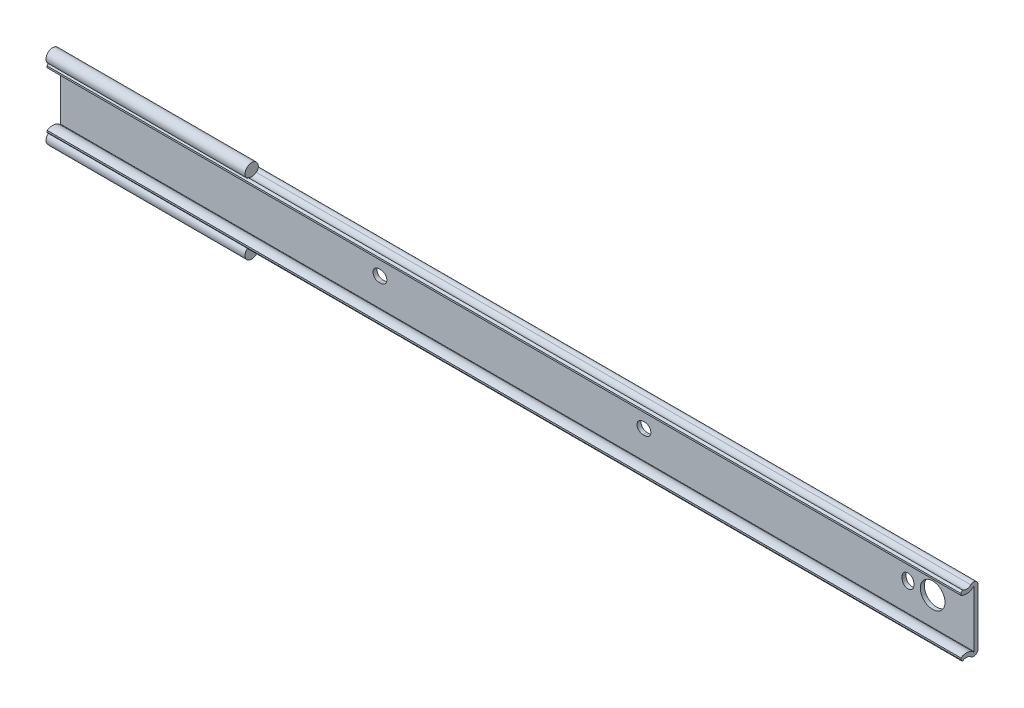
ISO-10303-21;
HEADER;
FILE_DESCRIPTION(('STEP AP214'),'2;1');
FILE_NAME('part.step','',(''),(''),'','','');
FILE_SCHEMA(('AUTOMOTIVE_DESIGN { 1 0 10303 214 1 1 1 1 }'));
ENDSEC;
DATA;
#1=APPLICATION_CONTEXT('core data for automotive mechanical design processes');
#2=APPLICATION_PROTOCOL_DEFINITION('international standard','automotive_design',2000,#1);
#3=PRODUCT_CONTEXT('',#1,'mechanical');
#4=PRODUCT('Part','Part','',(#3));
#5=PRODUCT_RELATED_PRODUCT_CATEGORY('part','',(#4));
#6=PRODUCT_DEFINITION_FORMATION('','',#4);
#7=PRODUCT_DEFINITION_CONTEXT('part definition',#1,'design');
#8=PRODUCT_DEFINITION('design','',#6,#7);
#9=PRODUCT_DEFINITION_SHAPE('','',#8);
#10=(LENGTH_UNIT() NAMED_UNIT(*) SI_UNIT(.MILLI.,.METRE.));
#11=(NAMED_UNIT(*) PLANE_ANGLE_UNIT() SI_UNIT($,.RADIAN.));
#12=(NAMED_UNIT(*) SI_UNIT($,.STERADIAN.) SOLID_ANGLE_UNIT());
#13=UNCERTAINTY_MEASURE_WITH_UNIT(LENGTH_MEASURE(1.E-05),#10,'distance_accuracy_value','');
#14=(GEOMETRIC_REPRESENTATION_CONTEXT(3) GLOBAL_UNCERTAINTY_ASSIGNED_CONTEXT((#13)) GLOBAL_UNIT_ASSIGNED_CONTEXT((#10,
#11,#12)) REPRESENTATION_CONTEXT('',''));
#15=CARTESIAN_POINT('',(0.,0.,0.));
#16=DIRECTION('',(0.,0.,1.));
#17=DIRECTION('',(1.,0.,0.));
#18=AXIS2_PLACEMENT_3D('',#15,#16,#17);
#19=CARTESIAN_POINT('',(-123.,13.9172237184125,4.44999970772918));
#20=DIRECTION('',(1.,0.,0.));
#21=DIRECTION('',(0.,0.,-1.));
#22=AXIS2_PLACEMENT_3D('',#19,#20,#21);
#23=CYLINDRICAL_SURFACE('',#22,2.55000008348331);
#24=DIRECTION('',(1.,0.,0.));
#25=VECTOR('',#24,1.);
#26=CARTESIAN_POINT('',(-123.,12.0075849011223,2.76009438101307));
#27=LINE('',#26,#25);
#28=CARTESIAN_POINT('',(-46.4,12.0075849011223,2.76009438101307));
#29=VERTEX_POINT('',#28);
#30=CARTESIAN_POINT('',(228.6,12.0075849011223,2.76009438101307));
#31=VERTEX_POINT('',#30);
#32=EDGE_CURVE('E356',#29,#31,#27,.T.);
#33=ORIENTED_EDGE('',*,*,#32,.F.);
#34=CARTESIAN_POINT('',(-46.4,13.9172237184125,4.44999970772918));
#35=DIRECTION('',(-1.,0.,0.));
#36=DIRECTION('',(0.,0.,1.));
#37=AXIS2_PLACEMENT_3D('',#34,#35,#36);
#38=CIRCLE('',#37,2.55000008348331);
#39=CARTESIAN_POINT('',(-46.4,11.8807031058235,5.98462807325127));
#40=VERTEX_POINT('',#39);
#41=EDGE_CURVE('E410',#29,#40,#38,.T.);
#42=ORIENTED_EDGE('',*,*,#41,.T.);
#43=DIRECTION('',(1.,0.,0.));
#44=VECTOR('',#43,1.);
#45=CARTESIAN_POINT('',(-123.,11.8807031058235,5.98462807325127));
#46=LINE('',#45,#44);
#47=CARTESIAN_POINT('',(228.6,11.8807031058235,5.98462807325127));
#48=VERTEX_POINT('',#47);
#49=EDGE_CURVE('E383',#40,#48,#46,.T.);
#50=ORIENTED_EDGE('',*,*,#49,.T.);
#51=CARTESIAN_POINT('',(228.6,13.9172237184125,4.44999970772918));
#52=DIRECTION('',(-1.,0.,0.));
#53=DIRECTION('',(0.,0.,-1.));
#54=AXIS2_PLACEMENT_3D('',#51,#52,#53);
#55=CIRCLE('',#54,2.55000008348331);
#56=EDGE_CURVE('E288',#31,#48,#55,.T.);
#57=ORIENTED_EDGE('',*,*,#56,.F.);
#58=EDGE_LOOP('',(#33,#42,#50,#57));
#59=FACE_BOUND('',#58,.T.);
#60=ADVANCED_FACE('F14',(#59),#23,.F.);
#61=CARTESIAN_POINT('',(-123.,-10.760000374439,0.));
#62=DIRECTION('',(0.,0.,-1.));
#63=DIRECTION('',(-1.,0.,0.));
#64=AXIS2_PLACEMENT_3D('',#61,#62,#63);
#65=PLANE('',#64);
#66=DIRECTION('',(0.,1.,0.));
#67=VECTOR('',#66,1.);
#68=CARTESIAN_POINT('',(-123.,-10.760000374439,0.));
#69=LINE('',#68,#67);
#70=CARTESIAN_POINT('',(-123.,-10.760000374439,0.));
#71=VERTEX_POINT('',#70);
#72=CARTESIAN_POINT('',(-123.,10.7644476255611,0.));
#73=VERTEX_POINT('',#72);
#74=EDGE_CURVE('E354',#71,#73,#69,.T.);
#75=ORIENTED_EDGE('',*,*,#74,.T.);
#76=DIRECTION('',(1.,0.,0.));
#77=VECTOR('',#76,1.);
#78=CARTESIAN_POINT('',(-123.,10.7644476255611,0.));
#79=LINE('',#78,#77);
#80=CARTESIAN_POINT('',(228.6,10.7644476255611,0.));
#81=VERTEX_POINT('',#80);
#82=EDGE_CURVE('E357',#73,#81,#79,.T.);
#83=ORIENTED_EDGE('',*,*,#82,.T.);
#84=DIRECTION('',(0.,1.,0.));
#85=VECTOR('',#84,1.);
#86=CARTESIAN_POINT('',(228.6,-10.760000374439,0.));
#87=LINE('',#86,#85);
#88=CARTESIAN_POINT('',(228.6,-10.760000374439,0.));
#89=VERTEX_POINT('',#88);
#90=EDGE_CURVE('E323',#89,#81,#87,.T.);
#91=ORIENTED_EDGE('',*,*,#90,.F.);
#92=DIRECTION('',(1.,0.,0.));
#93=VECTOR('',#92,1.);
#94=CARTESIAN_POINT('',(-123.,-10.760000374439,0.));
#95=LINE('',#94,#93);
#96=EDGE_CURVE('E360',#71,#89,#95,.T.);
#97=ORIENTED_EDGE('',*,*,#96,.F.);
#98=EDGE_LOOP('',(#75,#83,#91,#97));
#99=FACE_BOUND('',#98,.T.);
#100=CARTESIAN_POINT('',(212.7,0.00222299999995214,0.));
#101=DIRECTION('',(0.,0.,-1.));
#102=DIRECTION('',(-1.,0.,0.));
#103=AXIS2_PLACEMENT_3D('',#100,#101,#102);
#104=CIRCLE('',#103,4.75);
#105=CARTESIAN_POINT('',(207.95,0.00222299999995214,0.));
#106=VERTEX_POINT('',#105);
#107=EDGE_CURVE('E449',#106,#106,#104,.T.);
#108=ORIENTED_EDGE('',*,*,#107,.F.);
#109=EDGE_LOOP('',(#108));
#110=FACE_BOUND('',#109,.T.);
#111=CARTESIAN_POINT('',(102.,0.00222299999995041,0.));
#112=DIRECTION('',(0.,0.,-1.));
#113=DIRECTION('',(-1.,0.,0.));
#114=AXIS2_PLACEMENT_3D('',#111,#112,#113);
#115=CIRCLE('',#114,2.24999999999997);
#116=CARTESIAN_POINT('',(102.,2.25222299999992,0.));
#117=VERTEX_POINT('',#116);
#118=CARTESIAN_POINT('',(102.,-2.24777700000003,0.));
#119=VERTEX_POINT('',#118);
#120=EDGE_CURVE('E231',#117,#119,#115,.T.);
#121=ORIENTED_EDGE('',*,*,#120,.F.);
#122=DIRECTION('',(1.,0.,0.));
#123=VECTOR('',#122,1.);
#124=CARTESIAN_POINT('',(102.,2.25222299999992,0.));
#125=LINE('',#124,#123);
#126=CARTESIAN_POINT('',(101.2,2.25222299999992,0.));
#127=VERTEX_POINT('',#126);
#128=EDGE_CURVE('E236',#127,#117,#125,.T.);
#129=ORIENTED_EDGE('',*,*,#128,.F.);
#130=CARTESIAN_POINT('',(101.2,0.00222299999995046,0.));
#131=DIRECTION('',(0.,0.,-1.));
#132=DIRECTION('',(-1.,0.,0.));
#133=AXIS2_PLACEMENT_3D('',#130,#131,#132);
#134=CIRCLE('',#133,2.24999999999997);
#135=CARTESIAN_POINT('',(101.2,-2.24777700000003,0.));
#136=VERTEX_POINT('',#135);
#137=EDGE_CURVE('E215',#136,#127,#134,.T.);
#138=ORIENTED_EDGE('',*,*,#137,.F.);
#139=DIRECTION('',(-1.,0.,0.));
#140=VECTOR('',#139,1.);
#141=CARTESIAN_POINT('',(102.,-2.24777700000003,0.));
#142=LINE('',#141,#140);
#143=EDGE_CURVE('E226',#119,#136,#142,.T.);
#144=ORIENTED_EDGE('',*,*,#143,.F.);
#145=EDGE_LOOP('',(#121,#129,#138,#144));
#146=FACE_BOUND('',#145,.T.);
#147=CARTESIAN_POINT('',(203.2,-0.397777,0.));
#148=DIRECTION('',(0.,0.,-1.));
#149=DIRECTION('',(-1.,0.,0.));
#150=AXIS2_PLACEMENT_3D('',#147,#148,#149);
#151=CIRCLE('',#150,2.24999999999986);
#152=CARTESIAN_POINT('',(205.45,-0.397777,0.));
#153=VERTEX_POINT('',#152);
#154=CARTESIAN_POINT('',(200.95,-0.397777,0.));
#155=VERTEX_POINT('',#154);
#156=EDGE_CURVE('E243',#153,#155,#151,.T.);
#157=ORIENTED_EDGE('',*,*,#156,.F.);
#158=DIRECTION('',(0.,-1.,0.));
#159=VECTOR('',#158,1.);
#160=CARTESIAN_POINT('',(205.45,0.402222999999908,0.));
#161=LINE('',#160,#159);
#162=CARTESIAN_POINT('',(205.45,0.402222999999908,0.));
#163=VERTEX_POINT('',#162);
#164=EDGE_CURVE('E253',#163,#153,#161,.T.);
#165=ORIENTED_EDGE('',*,*,#164,.F.);
#166=CARTESIAN_POINT('',(203.2,0.402222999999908,0.));
#167=DIRECTION('',(0.,0.,-1.));
#168=DIRECTION('',(-1.,0.,0.));
#169=AXIS2_PLACEMENT_3D('',#166,#167,#168);
#170=CIRCLE('',#169,2.24999999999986);
#171=CARTESIAN_POINT('',(200.95,0.402222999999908,0.));
#172=VERTEX_POINT('',#171);
#173=EDGE_CURVE('E250',#172,#163,#170,.T.);
#174=ORIENTED_EDGE('',*,*,#173,.F.);
#175=DIRECTION('',(0.,1.,0.));
#176=VECTOR('',#175,1.);
#177=CARTESIAN_POINT('',(200.95,0.402222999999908,0.));
#178=LINE('',#177,#176);
#179=EDGE_CURVE('E247',#155,#172,#178,.T.);
#180=ORIENTED_EDGE('',*,*,#179,.F.);
#181=EDGE_LOOP('',(#157,#165,#174,#180));
#182=FACE_BOUND('',#181,.T.);
#183=CARTESIAN_POINT('',(-0.400000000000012,0.,0.));
#184=DIRECTION('',(0.,0.,-1.));
#185=DIRECTION('',(-1.,0.,0.));
#186=AXIS2_PLACEMENT_3D('',#183,#184,#185);
#187=CIRCLE('',#186,2.24999999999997);
#188=CARTESIAN_POINT('',(-0.400000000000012,-2.24999999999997,0.));
#189=VERTEX_POINT('',#188);
#190=CARTESIAN_POINT('',(-0.400000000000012,2.24999999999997,0.));
#191=VERTEX_POINT('',#190);
#192=EDGE_CURVE('E259',#189,#191,#187,.T.);
#193=ORIENTED_EDGE('',*,*,#192,.F.);
#194=DIRECTION('',(-1.,0.,0.));
#195=VECTOR('',#194,1.);
#196=CARTESIAN_POINT('',(0.400000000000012,-2.24999999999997,0.));
#197=LINE('',#196,#195);
#198=CARTESIAN_POINT('',(0.400000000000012,-2.24999999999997,0.));
#199=VERTEX_POINT('',#198);
#200=EDGE_CURVE('E273',#199,#189,#197,.T.);
#201=ORIENTED_EDGE('',*,*,#200,.F.);
#202=CARTESIAN_POINT('',(0.400000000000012,0.,0.));
#203=DIRECTION('',(0.,0.,-1.));
#204=DIRECTION('',(-1.,0.,0.));
#205=AXIS2_PLACEMENT_3D('',#202,#203,#204);
#206=CIRCLE('',#205,2.24999999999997);
#207=CARTESIAN_POINT('',(0.400000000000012,2.24999999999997,0.));
#208=VERTEX_POINT('',#207);
#209=EDGE_CURVE('E270',#208,#199,#206,.T.);
#210=ORIENTED_EDGE('',*,*,#209,.F.);
#211=DIRECTION('',(1.,0.,0.));
#212=VECTOR('',#211,1.);
#213=CARTESIAN_POINT('',(0.400000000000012,2.24999999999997,0.));
#214=LINE('',#213,#212);
#215=EDGE_CURVE('E267',#191,#208,#214,.T.);
#216=ORIENTED_EDGE('',*,*,#215,.F.);
#217=EDGE_LOOP('',(#193,#201,#210,#216));
#218=FACE_BOUND('',#217,.T.);
#219=ADVANCED_FACE('F233',(#99,#110,#146,#182,#218),#65,.T.);
#220=CARTESIAN_POINT('',(-123.,-10.7822812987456,1.54999983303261));
#221=DIRECTION('',(0.,0.,1.));
#222=DIRECTION('',(0.,-1.,0.));
#223=AXIS2_PLACEMENT_3D('',#220,#221,#222);
#224=PLANE('',#223);
#225=DIRECTION('',(0.,-1.,0.));
#226=VECTOR('',#225,1.);
#227=CARTESIAN_POINT('',(-123.,-10.7822812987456,1.54999983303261));
#228=LINE('',#227,#226);
#229=CARTESIAN_POINT('',(-123.,10.7867285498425,1.54999983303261));
#230=VERTEX_POINT('',#229);
#231=CARTESIAN_POINT('',(-123.,-10.7822812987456,1.54999983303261));
#232=VERTEX_POINT('',#231);
#233=EDGE_CURVE('E339',#230,#232,#228,.T.);
#234=ORIENTED_EDGE('',*,*,#233,.T.);
#235=DIRECTION('',(1.,0.,0.));
#236=VECTOR('',#235,1.);
#237=CARTESIAN_POINT('',(-123.,-10.7822812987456,1.54999983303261));
#238=LINE('',#237,#236);
#239=CARTESIAN_POINT('',(228.6,-10.7822812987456,1.54999983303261));
#240=VERTEX_POINT('',#239);
#241=EDGE_CURVE('E373',#232,#240,#238,.T.);
#242=ORIENTED_EDGE('',*,*,#241,.T.);
#243=DIRECTION('',(0.,-1.,0.));
#244=VECTOR('',#243,1.);
#245=CARTESIAN_POINT('',(228.6,-10.7822812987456,1.54999983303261));
#246=LINE('',#245,#244);
#247=CARTESIAN_POINT('',(228.6,10.7867285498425,1.54999983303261));
#248=VERTEX_POINT('',#247);
#249=EDGE_CURVE('E303',#248,#240,#246,.T.);
#250=ORIENTED_EDGE('',*,*,#249,.F.);
#251=DIRECTION('',(1.,0.,0.));
#252=VECTOR('',#251,1.);
#253=CARTESIAN_POINT('',(-123.,10.7867285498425,1.54999983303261));
#254=LINE('',#253,#252);
#255=EDGE_CURVE('E375',#230,#248,#254,.T.);
#256=ORIENTED_EDGE('',*,*,#255,.F.);
#257=EDGE_LOOP('',(#234,#242,#250,#256));
#258=FACE_BOUND('',#257,.T.);
#259=CARTESIAN_POINT('',(212.7,0.00222299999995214,1.54999983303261));
#260=DIRECTION('',(0.,0.,1.));
#261=DIRECTION('',(0.,-1.,0.));
#262=AXIS2_PLACEMENT_3D('',#259,#260,#261);
#263=CIRCLE('',#262,4.75);
#264=CARTESIAN_POINT('',(212.7,-4.74777700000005,1.54999983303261));
#265=VERTEX_POINT('',#264);
#266=EDGE_CURVE('E448',#265,#265,#263,.F.);
#267=ORIENTED_EDGE('',*,*,#266,.T.);
#268=EDGE_LOOP('',(#267));
#269=FACE_BOUND('',#268,.T.);
#270=CARTESIAN_POINT('',(102.,0.00222299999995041,1.54999983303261));
#271=DIRECTION('',(0.,0.,1.));
#272=DIRECTION('',(0.,-1.,0.));
#273=AXIS2_PLACEMENT_3D('',#270,#271,#272);
#274=CIRCLE('',#273,2.24999999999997);
#275=CARTESIAN_POINT('',(102.,-2.24777700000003,1.54999983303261));
#276=VERTEX_POINT('',#275);
#277=CARTESIAN_POINT('',(102.,2.25222299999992,1.54999983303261));
#278=VERTEX_POINT('',#277);
#279=EDGE_CURVE('E408',#276,#278,#274,.T.);
#280=ORIENTED_EDGE('',*,*,#279,.F.);
#281=DIRECTION('',(1.,0.,0.));
#282=VECTOR('',#281,1.);
#283=CARTESIAN_POINT('',(-123.,-2.24777700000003,1.54999983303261));
#284=LINE('',#283,#282);
#285=CARTESIAN_POINT('',(101.2,-2.24777700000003,1.54999983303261));
#286=VERTEX_POINT('',#285);
#287=EDGE_CURVE('E403',#286,#276,#284,.T.);
#288=ORIENTED_EDGE('',*,*,#287,.F.);
#289=CARTESIAN_POINT('',(101.2,0.00222299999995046,1.54999983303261));
#290=DIRECTION('',(0.,0.,1.));
#291=DIRECTION('',(0.,-1.,0.));
#292=AXIS2_PLACEMENT_3D('',#289,#290,#291);
#293=CIRCLE('',#292,2.24999999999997);
#294=CARTESIAN_POINT('',(101.2,2.25222299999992,1.54999983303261));
#295=VERTEX_POINT('',#294);
#296=EDGE_CURVE('E218',#295,#286,#293,.T.);
#297=ORIENTED_EDGE('',*,*,#296,.F.);
#298=DIRECTION('',(-1.,0.,0.));
#299=VECTOR('',#298,1.);
#300=CARTESIAN_POINT('',(-123.,2.25222299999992,1.54999983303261));
#301=LINE('',#300,#299);
#302=EDGE_CURVE('E406',#278,#295,#301,.T.);
#303=ORIENTED_EDGE('',*,*,#302,.F.);
#304=EDGE_LOOP('',(#280,#288,#297,#303));
#305=FACE_BOUND('',#304,.T.);
#306=CARTESIAN_POINT('',(203.2,-0.397777,1.54999983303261));
#307=DIRECTION('',(0.,0.,1.));
#308=DIRECTION('',(0.,-1.,0.));
#309=AXIS2_PLACEMENT_3D('',#306,#307,#308);
#310=CIRCLE('',#309,2.24999999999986);
#311=CARTESIAN_POINT('',(200.95,-0.397777,1.54999983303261));
#312=VERTEX_POINT('',#311);
#313=CARTESIAN_POINT('',(205.45,-0.397777,1.54999983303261));
#314=VERTEX_POINT('',#313);
#315=EDGE_CURVE('E401',#312,#314,#310,.T.);
#316=ORIENTED_EDGE('',*,*,#315,.F.);
#317=DIRECTION('',(0.,-1.,0.));
#318=VECTOR('',#317,1.);
#319=CARTESIAN_POINT('',(200.95,-10.7822812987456,1.54999983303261));
#320=LINE('',#319,#318);
#321=CARTESIAN_POINT('',(200.95,0.402222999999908,1.54999983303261));
#322=VERTEX_POINT('',#321);
#323=EDGE_CURVE('E394',#322,#312,#320,.T.);
#324=ORIENTED_EDGE('',*,*,#323,.F.);
#325=CARTESIAN_POINT('',(203.2,0.402222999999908,1.54999983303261));
#326=DIRECTION('',(0.,0.,1.));
#327=DIRECTION('',(0.,-1.,0.));
#328=AXIS2_PLACEMENT_3D('',#325,#326,#327);
#329=CIRCLE('',#328,2.24999999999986);
#330=CARTESIAN_POINT('',(205.45,0.402222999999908,1.54999983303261));
#331=VERTEX_POINT('',#330);
#332=EDGE_CURVE('E396',#331,#322,#329,.T.);
#333=ORIENTED_EDGE('',*,*,#332,.F.);
#334=DIRECTION('',(0.,1.,0.));
#335=VECTOR('',#334,1.);
#336=CARTESIAN_POINT('',(205.45,-10.7822812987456,1.54999983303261));
#337=LINE('',#336,#335);
#338=EDGE_CURVE('E399',#314,#331,#337,.T.);
#339=ORIENTED_EDGE('',*,*,#338,.F.);
#340=EDGE_LOOP('',(#316,#324,#333,#339));
#341=FACE_BOUND('',#340,.T.);
#342=CARTESIAN_POINT('',(-0.400000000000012,0.,1.54999983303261));
#343=DIRECTION('',(0.,0.,1.));
#344=DIRECTION('',(0.,-1.,0.));
#345=AXIS2_PLACEMENT_3D('',#342,#343,#344);
#346=CIRCLE('',#345,2.24999999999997);
#347=CARTESIAN_POINT('',(-0.400000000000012,2.24999999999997,1.54999983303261));
#348=VERTEX_POINT('',#347);
#349=CARTESIAN_POINT('',(-0.400000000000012,-2.24999999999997,1.54999983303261));
#350=VERTEX_POINT('',#349);
#351=EDGE_CURVE('E392',#348,#350,#346,.T.);
#352=ORIENTED_EDGE('',*,*,#351,.F.);
#353=DIRECTION('',(-1.,0.,0.));
#354=VECTOR('',#353,1.);
#355=CARTESIAN_POINT('',(-123.,2.24999999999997,1.54999983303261));
#356=LINE('',#355,#354);
#357=CARTESIAN_POINT('',(0.400000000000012,2.24999999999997,1.54999983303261));
#358=VERTEX_POINT('',#357);
#359=EDGE_CURVE('E359',#358,#348,#356,.T.);
#360=ORIENTED_EDGE('',*,*,#359,.F.);
#361=CARTESIAN_POINT('',(0.400000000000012,0.,1.54999983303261));
#362=DIRECTION('',(0.,0.,1.));
#363=DIRECTION('',(0.,-1.,0.));
#364=AXIS2_PLACEMENT_3D('',#361,#362,#363);
#365=CIRCLE('',#364,2.24999999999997);
#366=CARTESIAN_POINT('',(0.400000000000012,-2.24999999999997,1.54999983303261));
#367=VERTEX_POINT('',#366);
#368=EDGE_CURVE('E387',#367,#358,#365,.T.);
#369=ORIENTED_EDGE('',*,*,#368,.F.);
#370=DIRECTION('',(1.,0.,0.));
#371=VECTOR('',#370,1.);
#372=CARTESIAN_POINT('',(-123.,-2.24999999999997,1.54999983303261));
#373=LINE('',#372,#371);
#374=EDGE_CURVE('E390',#350,#367,#373,.T.);
#375=ORIENTED_EDGE('',*,*,#374,.F.);
#376=EDGE_LOOP('',(#352,#360,#369,#375));
#377=FACE_BOUND('',#376,.T.);
#378=ADVANCED_FACE('F461',(#258,#269,#305,#341,#377),#224,.T.);
#379=CARTESIAN_POINT('',(-123.,10.7644476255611,1.65999962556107));
#380=DIRECTION('',(1.,0.,0.));
#381=DIRECTION('',(0.,0.,-1.));
#382=AXIS2_PLACEMENT_3D('',#379,#380,#381);
#383=PLANE('',#382);
#384=CARTESIAN_POINT('',(-123.,-10.760000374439,1.65999962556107));
#385=DIRECTION('',(1.,0.,0.));
#386=DIRECTION('',(0.,0.,1.));
#387=AXIS2_PLACEMENT_3D('',#384,#385,#386);
#388=CIRCLE('',#387,1.65999962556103);
#389=CARTESIAN_POINT('',(-123.,-12.2943067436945,2.29364205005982));
#390=VERTEX_POINT('',#389);
#391=EDGE_CURVE('E352',#390,#71,#388,.T.);
#392=ORIENTED_EDGE('',*,*,#391,.F.);
#393=CARTESIAN_POINT('',(-123.,-13.5727763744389,4.5));
#394=DIRECTION('',(-1.,0.,0.));
#395=DIRECTION('',(0.,0.,-1.));
#396=AXIS2_PLACEMENT_3D('',#393,#394,#395);
#397=CIRCLE('',#396,2.55);
#398=CARTESIAN_POINT('',(-123.,-11.6396154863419,6.16294587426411));
#399=VERTEX_POINT('',#398);
#400=EDGE_CURVE('E428',#390,#399,#397,.T.);
#401=ORIENTED_EDGE('',*,*,#400,.T.);
#402=DIRECTION('',(0.,-0.798635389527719,-0.601815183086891));
#403=VECTOR('',#402,1.);
#404=CARTESIAN_POINT('',(-123.,-11.8762536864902,5.98462612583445));
#405=LINE('',#404,#403);
#406=CARTESIAN_POINT('',(-123.,-11.0596308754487,6.59999580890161));
#407=VERTEX_POINT('',#406);
#408=EDGE_CURVE('E350',#407,#399,#405,.T.);
#409=ORIENTED_EDGE('',*,*,#408,.F.);
#410=DIRECTION('',(0.,-1.,0.));
#411=VECTOR('',#410,1.);
#412=CARTESIAN_POINT('',(-123.,-11.0596308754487,6.59999580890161));
#413=LINE('',#412,#411);
#414=CARTESIAN_POINT('',(-123.,-10.4217168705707,6.59999580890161));
#415=VERTEX_POINT('',#414);
#416=EDGE_CURVE('E347',#415,#407,#413,.T.);
#417=ORIENTED_EDGE('',*,*,#416,.F.);
#418=CARTESIAN_POINT('',(-123.,-13.9127740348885,4.44999754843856));
#419=DIRECTION('',(1.,0.,0.));
#420=DIRECTION('',(0.,0.,1.));
#421=AXIS2_PLACEMENT_3D('',#418,#419,#420);
#422=CIRCLE('',#421,4.09999666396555);
#423=CARTESIAN_POINT('',(-123.,-10.8568168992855,1.71666649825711));
#424=VERTEX_POINT('',#423);
#425=EDGE_CURVE('E344',#424,#415,#422,.T.);
#426=ORIENTED_EDGE('',*,*,#425,.F.);
#427=CARTESIAN_POINT('',(-123.,-10.7822812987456,1.64999983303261));
#428=DIRECTION('',(-1.,0.,0.));
#429=DIRECTION('',(0.,0.,-1.));
#430=AXIS2_PLACEMENT_3D('',#427,#428,#429);
#431=CIRCLE('',#430,0.1);
#432=EDGE_CURVE('E341',#232,#424,#431,.T.);
#433=ORIENTED_EDGE('',*,*,#432,.F.);
#434=ORIENTED_EDGE('',*,*,#233,.F.);
#435=CARTESIAN_POINT('',(-123.,10.7867285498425,1.64999983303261));
#436=DIRECTION('',(-1.,0.,0.));
#437=DIRECTION('',(0.,0.,1.));
#438=AXIS2_PLACEMENT_3D('',#435,#436,#437);
#439=CIRCLE('',#438,0.1);
#440=CARTESIAN_POINT('',(-123.,10.8612641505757,1.71666649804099));
#441=VERTEX_POINT('',#440);
#442=EDGE_CURVE('E336',#441,#230,#439,.T.);
#443=ORIENTED_EDGE('',*,*,#442,.F.);
#444=CARTESIAN_POINT('',(-123.,13.9172237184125,4.44999970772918));
#445=DIRECTION('',(1.,0.,0.));
#446=DIRECTION('',(0.,0.,-1.));
#447=AXIS2_PLACEMENT_3D('',#444,#445,#446);
#448=CIRCLE('',#447,4.09999991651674);
#449=CARTESIAN_POINT('',(-123.,10.4261637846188,6.59999967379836));
#450=VERTEX_POINT('',#449);
#451=EDGE_CURVE('E333',#450,#441,#448,.T.);
#452=ORIENTED_EDGE('',*,*,#451,.F.);
#453=DIRECTION('',(0.,-1.,1.54366169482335E-08));
#454=VECTOR('',#453,1.);
#455=CARTESIAN_POINT('',(-123.,11.0640777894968,6.59999966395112));
#456=LINE('',#455,#454);
#457=CARTESIAN_POINT('',(-123.,11.0640777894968,6.59999966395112));
#458=VERTEX_POINT('',#457);
#459=EDGE_CURVE('E330',#458,#450,#456,.T.);
#460=ORIENTED_EDGE('',*,*,#459,.F.);
#461=DIRECTION('',(0.,-0.798635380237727,0.601815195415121));
#462=VECTOR('',#461,1.);
#463=CARTESIAN_POINT('',(-123.,11.8807031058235,5.98462807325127));
#464=LINE('',#463,#462);
#465=CARTESIAN_POINT('',(-123.,11.6440646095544,6.16294805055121));
#466=VERTEX_POINT('',#465);
#467=EDGE_CURVE('E328',#466,#458,#464,.T.);
#468=ORIENTED_EDGE('',*,*,#467,.F.);
#469=CARTESIAN_POINT('',(-123.,13.5772236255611,4.5));
#470=DIRECTION('',(-1.,0.,0.));
#471=DIRECTION('',(0.,0.,1.));
#472=AXIS2_PLACEMENT_3D('',#469,#470,#471);
#473=CIRCLE('',#472,2.55);
#474=CARTESIAN_POINT('',(-123.,12.2987539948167,2.29364205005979));
#475=VERTEX_POINT('',#474);
#476=EDGE_CURVE('E435',#466,#475,#473,.T.);
#477=ORIENTED_EDGE('',*,*,#476,.T.);
#478=CARTESIAN_POINT('',(-123.,10.7644476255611,1.65999962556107));
#479=DIRECTION('',(1.,0.,0.));
#480=DIRECTION('',(0.,0.,-1.));
#481=AXIS2_PLACEMENT_3D('',#478,#479,#480);
#482=CIRCLE('',#481,1.65999962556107);
#483=EDGE_CURVE('E326',#73,#475,#482,.T.);
#484=ORIENTED_EDGE('',*,*,#483,.F.);
#485=ORIENTED_EDGE('',*,*,#74,.F.);
#486=EDGE_LOOP('',(#392,#401,#409,#417,#426,#433,#434,#443,#452,#460,#468,#477,#484,#485));
#487=FACE_BOUND('',#486,.T.);
#488=ADVANCED_FACE('F464',(#487),#383,.F.);
#489=CARTESIAN_POINT('',(-123.,10.7644476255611,1.65999962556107));
#490=DIRECTION('',(1.,0.,0.));
#491=DIRECTION('',(0.,0.,-1.));
#492=AXIS2_PLACEMENT_3D('',#489,#490,#491);
#493=CYLINDRICAL_SURFACE('',#492,1.65999962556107);
#494=DIRECTION('',(-1.,0.,0.));
#495=VECTOR('',#494,1.);
#496=CARTESIAN_POINT('',(-84.7,12.2987539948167,2.29364205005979));
#497=LINE('',#496,#495);
#498=CARTESIAN_POINT('',(-46.4,12.2987539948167,2.29364205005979));
#499=VERTEX_POINT('',#498);
#500=EDGE_CURVE('E445',#499,#475,#497,.T.);
#501=ORIENTED_EDGE('',*,*,#500,.F.);
#502=CARTESIAN_POINT('',(-46.4,10.7644476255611,1.65999962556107));
#503=DIRECTION('',(-1.,0.,0.));
#504=DIRECTION('',(0.,0.,1.));
#505=AXIS2_PLACEMENT_3D('',#502,#503,#504);
#506=CIRCLE('',#505,1.65999962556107);
#507=EDGE_CURVE('E443',#499,#29,#506,.F.);
#508=ORIENTED_EDGE('',*,*,#507,.T.);
#509=ORIENTED_EDGE('',*,*,#32,.T.);
#510=CARTESIAN_POINT('',(228.6,10.7644476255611,1.65999962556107));
#511=DIRECTION('',(1.,0.,0.));
#512=DIRECTION('',(0.,0.,-1.));
#513=AXIS2_PLACEMENT_3D('',#510,#511,#512);
#514=CIRCLE('',#513,1.65999962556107);
#515=EDGE_CURVE('E279',#81,#31,#514,.T.);
#516=ORIENTED_EDGE('',*,*,#515,.F.);
#517=ORIENTED_EDGE('',*,*,#82,.F.);
#518=ORIENTED_EDGE('',*,*,#483,.T.);
#519=EDGE_LOOP('',(#501,#508,#509,#516,#517,#518));
#520=FACE_BOUND('',#519,.T.);
#521=ADVANCED_FACE('F16',(#520),#493,.T.);
#522=CARTESIAN_POINT('',(-123.,-10.760000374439,1.65999962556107));
#523=DIRECTION('',(1.,0.,0.));
#524=DIRECTION('',(0.,0.,-1.));
#525=AXIS2_PLACEMENT_3D('',#522,#523,#524);
#526=CYLINDRICAL_SURFACE('',#525,1.65999962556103);
#527=DIRECTION('',(-1.,0.,0.));
#528=VECTOR('',#527,1.);
#529=CARTESIAN_POINT('',(-84.7,-12.2943067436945,2.29364205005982));
#530=LINE('',#529,#528);
#531=CARTESIAN_POINT('',(-46.4,-12.2943067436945,2.29364205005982));
#532=VERTEX_POINT('',#531);
#533=EDGE_CURVE('E33',#390,#532,#530,.F.);
#534=ORIENTED_EDGE('',*,*,#533,.F.);
#535=ORIENTED_EDGE('',*,*,#391,.T.);
#536=ORIENTED_EDGE('',*,*,#96,.T.);
#537=CARTESIAN_POINT('',(228.6,-10.760000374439,1.65999962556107));
#538=DIRECTION('',(1.,0.,0.));
#539=DIRECTION('',(0.,0.,1.));
#540=AXIS2_PLACEMENT_3D('',#537,#538,#539);
#541=CIRCLE('',#540,1.65999962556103);
#542=CARTESIAN_POINT('',(228.6,-12.0014631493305,2.76198371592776));
#543=VERTEX_POINT('',#542);
#544=EDGE_CURVE('E321',#543,#89,#541,.T.);
#545=ORIENTED_EDGE('',*,*,#544,.F.);
#546=DIRECTION('',(1.,0.,0.));
#547=VECTOR('',#546,1.);
#548=CARTESIAN_POINT('',(-123.,-12.0014631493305,2.76198371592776));
#549=LINE('',#548,#547);
#550=CARTESIAN_POINT('',(-46.4,-12.0014631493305,2.76198371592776));
#551=VERTEX_POINT('',#550);
#552=EDGE_CURVE('E363',#551,#543,#549,.T.);
#553=ORIENTED_EDGE('',*,*,#552,.F.);
#554=CARTESIAN_POINT('',(-46.4,-10.760000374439,1.65999962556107));
#555=DIRECTION('',(1.,0.,0.));
#556=DIRECTION('',(0.,0.,-1.));
#557=AXIS2_PLACEMENT_3D('',#554,#555,#556);
#558=CIRCLE('',#557,1.65999962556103);
#559=EDGE_CURVE('E29',#532,#551,#558,.F.);
#560=ORIENTED_EDGE('',*,*,#559,.F.);
#561=EDGE_LOOP('',(#534,#535,#536,#545,#553,#560));
#562=FACE_BOUND('',#561,.T.);
#563=ADVANCED_FACE('F547',(#562),#526,.T.);
#564=CARTESIAN_POINT('',(-123.,-13.9127740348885,4.44999754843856));
#565=DIRECTION('',(1.,0.,0.));
#566=DIRECTION('',(0.,0.,-1.));
#567=AXIS2_PLACEMENT_3D('',#564,#565,#566);
#568=CYLINDRICAL_SURFACE('',#567,2.55000000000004);
#569=CARTESIAN_POINT('',(-46.4,-13.9127740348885,4.44999754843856));
#570=DIRECTION('',(1.,0.,0.));
#571=DIRECTION('',(0.,0.,-1.));
#572=AXIS2_PLACEMENT_3D('',#569,#570,#571);
#573=CIRCLE('',#572,2.55000000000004);
#574=CARTESIAN_POINT('',(-46.4,-11.8762536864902,5.98462612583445));
#575=VERTEX_POINT('',#574);
#576=EDGE_CURVE('E421',#551,#575,#573,.T.);
#577=ORIENTED_EDGE('',*,*,#576,.F.);
#578=ORIENTED_EDGE('',*,*,#552,.T.);
#579=CARTESIAN_POINT('',(228.6,-13.9127740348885,4.44999754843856));
#580=DIRECTION('',(-1.,0.,0.));
#581=DIRECTION('',(0.,0.,1.));
#582=AXIS2_PLACEMENT_3D('',#579,#580,#581);
#583=CIRCLE('',#582,2.55000000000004);
#584=CARTESIAN_POINT('',(228.6,-11.8762536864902,5.98462612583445));
#585=VERTEX_POINT('',#584);
#586=EDGE_CURVE('E318',#585,#543,#583,.T.);
#587=ORIENTED_EDGE('',*,*,#586,.F.);
#588=DIRECTION('',(1.,0.,0.));
#589=VECTOR('',#588,1.);
#590=CARTESIAN_POINT('',(-123.,-11.8762536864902,5.98462612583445));
#591=LINE('',#590,#589);
#592=EDGE_CURVE('E365',#575,#585,#591,.T.);
#593=ORIENTED_EDGE('',*,*,#592,.F.);
#594=EDGE_LOOP('',(#577,#578,#587,#593));
#595=FACE_BOUND('',#594,.T.);
#596=ADVANCED_FACE('F544',(#595),#568,.F.);
#597=CARTESIAN_POINT('',(-123.,-11.8762536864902,5.98462612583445));
#598=DIRECTION('',(0.,-0.601815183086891,0.798635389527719));
#599=DIRECTION('',(0.,-0.798635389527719,-0.601815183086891));
#600=AXIS2_PLACEMENT_3D('',#597,#598,#599);
#601=PLANE('',#600);
#602=DIRECTION('',(-1.,0.,0.));
#603=VECTOR('',#602,1.);
#604=CARTESIAN_POINT('',(-46.4,-11.6396154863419,6.16294587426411));
#605=LINE('',#604,#603);
#606=CARTESIAN_POINT('',(-46.4,-11.6396154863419,6.16294587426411));
#607=VERTEX_POINT('',#606);
#608=EDGE_CURVE('E9',#607,#399,#605,.T.);
#609=ORIENTED_EDGE('',*,*,#608,.F.);
#610=DIRECTION('',(0.,0.798635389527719,0.601815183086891));
#611=VECTOR('',#610,1.);
#612=CARTESIAN_POINT('',(-46.4,-11.8762536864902,5.98462612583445));
#613=LINE('',#612,#611);
#614=EDGE_CURVE('E22',#575,#607,#613,.T.);
#615=ORIENTED_EDGE('',*,*,#614,.F.);
#616=ORIENTED_EDGE('',*,*,#592,.T.);
#617=DIRECTION('',(0.,-0.798635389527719,-0.601815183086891));
#618=VECTOR('',#617,1.);
#619=CARTESIAN_POINT('',(228.6,-11.8762536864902,5.98462612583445));
#620=LINE('',#619,#618);
#621=CARTESIAN_POINT('',(228.6,-11.0596308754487,6.59999580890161));
#622=VERTEX_POINT('',#621);
#623=EDGE_CURVE('E315',#622,#585,#620,.T.);
#624=ORIENTED_EDGE('',*,*,#623,.F.);
#625=DIRECTION('',(1.,0.,0.));
#626=VECTOR('',#625,1.);
#627=CARTESIAN_POINT('',(-123.,-11.0596308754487,6.59999580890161));
#628=LINE('',#627,#626);
#629=EDGE_CURVE('E367',#407,#622,#628,.T.);
#630=ORIENTED_EDGE('',*,*,#629,.F.);
#631=ORIENTED_EDGE('',*,*,#408,.T.);
#632=EDGE_LOOP('',(#609,#615,#616,#624,#630,#631));
#633=FACE_BOUND('',#632,.T.);
#634=ADVANCED_FACE('F540',(#633),#601,.T.);
#635=CARTESIAN_POINT('',(-123.,-11.0596308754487,6.59999580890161));
#636=DIRECTION('',(0.,0.,1.));
#637=DIRECTION('',(1.,0.,0.));
#638=AXIS2_PLACEMENT_3D('',#635,#636,#637);
#639=PLANE('',#638);
#640=DIRECTION('',(0.,-1.,0.));
#641=VECTOR('',#640,1.);
#642=CARTESIAN_POINT('',(228.6,-11.0596308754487,6.59999580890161));
#643=LINE('',#642,#641);
#644=CARTESIAN_POINT('',(228.6,-10.4217168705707,6.59999580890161));
#645=VERTEX_POINT('',#644);
#646=EDGE_CURVE('E312',#645,#622,#643,.T.);
#647=ORIENTED_EDGE('',*,*,#646,.F.);
#648=DIRECTION('',(1.,0.,0.));
#649=VECTOR('',#648,1.);
#650=CARTESIAN_POINT('',(-123.,-10.4217168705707,6.59999580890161));
#651=LINE('',#650,#649);
#652=EDGE_CURVE('E369',#415,#645,#651,.T.);
#653=ORIENTED_EDGE('',*,*,#652,.F.);
#654=ORIENTED_EDGE('',*,*,#416,.T.);
#655=ORIENTED_EDGE('',*,*,#629,.T.);
#656=EDGE_LOOP('',(#647,#653,#654,#655));
#657=FACE_BOUND('',#656,.T.);
#658=ADVANCED_FACE('F536',(#657),#639,.T.);
#659=CARTESIAN_POINT('',(-123.,-13.9127740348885,4.44999754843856));
#660=DIRECTION('',(1.,0.,0.));
#661=DIRECTION('',(0.,0.,-1.));
#662=AXIS2_PLACEMENT_3D('',#659,#660,#661);
#663=CYLINDRICAL_SURFACE('',#662,4.09999666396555);
#664=CARTESIAN_POINT('',(228.6,-13.9127740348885,4.44999754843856));
#665=DIRECTION('',(1.,0.,0.));
#666=DIRECTION('',(0.,0.,1.));
#667=AXIS2_PLACEMENT_3D('',#664,#665,#666);
#668=CIRCLE('',#667,4.09999666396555);
#669=CARTESIAN_POINT('',(228.6,-10.8568168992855,1.71666649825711));
#670=VERTEX_POINT('',#669);
#671=EDGE_CURVE('E309',#670,#645,#668,.T.);
#672=ORIENTED_EDGE('',*,*,#671,.F.);
#673=DIRECTION('',(1.,0.,0.));
#674=VECTOR('',#673,1.);
#675=CARTESIAN_POINT('',(-123.,-10.8568168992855,1.71666649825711));
#676=LINE('',#675,#674);
#677=EDGE_CURVE('E371',#424,#670,#676,.T.);
#678=ORIENTED_EDGE('',*,*,#677,.F.);
#679=ORIENTED_EDGE('',*,*,#425,.T.);
#680=ORIENTED_EDGE('',*,*,#652,.T.);
#681=EDGE_LOOP('',(#672,#678,#679,#680));
#682=FACE_BOUND('',#681,.T.);
#683=ADVANCED_FACE('F532',(#682),#663,.T.);
#684=CARTESIAN_POINT('',(-123.,-10.7822812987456,1.64999983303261));
#685=DIRECTION('',(1.,0.,0.));
#686=DIRECTION('',(0.,0.,-1.));
#687=AXIS2_PLACEMENT_3D('',#684,#685,#686);
#688=CYLINDRICAL_SURFACE('',#687,0.1);
#689=CARTESIAN_POINT('',(228.6,-10.7822812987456,1.64999983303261));
#690=DIRECTION('',(-1.,0.,0.));
#691=DIRECTION('',(0.,0.,-1.));
#692=AXIS2_PLACEMENT_3D('',#689,#690,#691);
#693=CIRCLE('',#692,0.1);
#694=EDGE_CURVE('E306',#240,#670,#693,.T.);
#695=ORIENTED_EDGE('',*,*,#694,.F.);
#696=ORIENTED_EDGE('',*,*,#241,.F.);
#697=ORIENTED_EDGE('',*,*,#432,.T.);
#698=ORIENTED_EDGE('',*,*,#677,.T.);
#699=EDGE_LOOP('',(#695,#696,#697,#698));
#700=FACE_BOUND('',#699,.T.);
#701=ADVANCED_FACE('F527',(#700),#688,.F.);
#702=CARTESIAN_POINT('',(-123.,10.7867285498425,1.64999983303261));
#703=DIRECTION('',(1.,0.,0.));
#704=DIRECTION('',(0.,0.,-1.));
#705=AXIS2_PLACEMENT_3D('',#702,#703,#704);
#706=CYLINDRICAL_SURFACE('',#705,0.1);
#707=CARTESIAN_POINT('',(228.6,10.7867285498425,1.64999983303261));
#708=DIRECTION('',(-1.,0.,0.));
#709=DIRECTION('',(0.,0.,1.));
#710=AXIS2_PLACEMENT_3D('',#707,#708,#709);
#711=CIRCLE('',#710,0.1);
#712=CARTESIAN_POINT('',(228.6,10.8612641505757,1.71666649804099));
#713=VERTEX_POINT('',#712);
#714=EDGE_CURVE('E300',#713,#248,#711,.T.);
#715=ORIENTED_EDGE('',*,*,#714,.F.);
#716=DIRECTION('',(1.,0.,0.));
#717=VECTOR('',#716,1.);
#718=CARTESIAN_POINT('',(-123.,10.8612641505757,1.71666649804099));
#719=LINE('',#718,#717);
#720=EDGE_CURVE('E377',#441,#713,#719,.T.);
#721=ORIENTED_EDGE('',*,*,#720,.F.);
#722=ORIENTED_EDGE('',*,*,#442,.T.);
#723=ORIENTED_EDGE('',*,*,#255,.T.);
#724=EDGE_LOOP('',(#715,#721,#722,#723));
#725=FACE_BOUND('',#724,.T.);
#726=ADVANCED_FACE('F524',(#725),#706,.F.);
#727=CARTESIAN_POINT('',(-123.,13.9172237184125,4.44999970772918));
#728=DIRECTION('',(1.,0.,0.));
#729=DIRECTION('',(0.,0.,-1.));
#730=AXIS2_PLACEMENT_3D('',#727,#728,#729);
#731=CYLINDRICAL_SURFACE('',#730,4.09999991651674);
#732=CARTESIAN_POINT('',(228.6,13.9172237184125,4.44999970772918));
#733=DIRECTION('',(1.,0.,0.));
#734=DIRECTION('',(0.,0.,-1.));
#735=AXIS2_PLACEMENT_3D('',#732,#733,#734);
#736=CIRCLE('',#735,4.09999991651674);
#737=CARTESIAN_POINT('',(228.6,10.4261637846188,6.59999967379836));
#738=VERTEX_POINT('',#737);
#739=EDGE_CURVE('E297',#738,#713,#736,.T.);
#740=ORIENTED_EDGE('',*,*,#739,.F.);
#741=DIRECTION('',(1.,0.,0.));
#742=VECTOR('',#741,1.);
#743=CARTESIAN_POINT('',(-123.,10.4261637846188,6.59999967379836));
#744=LINE('',#743,#742);
#745=EDGE_CURVE('E379',#450,#738,#744,.T.);
#746=ORIENTED_EDGE('',*,*,#745,.F.);
#747=ORIENTED_EDGE('',*,*,#451,.T.);
#748=ORIENTED_EDGE('',*,*,#720,.T.);
#749=EDGE_LOOP('',(#740,#746,#747,#748));
#750=FACE_BOUND('',#749,.T.);
#751=ADVANCED_FACE('F520',(#750),#731,.T.);
#752=CARTESIAN_POINT('',(-123.,11.0640777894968,6.59999966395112));
#753=DIRECTION('',(0.,1.54366169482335E-08,1.));
#754=DIRECTION('',(0.,-1.,1.54366169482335E-08));
#755=AXIS2_PLACEMENT_3D('',#752,#753,#754);
#756=PLANE('',#755);
#757=DIRECTION('',(0.,-1.,1.54366169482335E-08));
#758=VECTOR('',#757,1.);
#759=CARTESIAN_POINT('',(228.6,11.0640777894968,6.59999966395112));
#760=LINE('',#759,#758);
#761=CARTESIAN_POINT('',(228.6,11.0640777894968,6.59999966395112));
#762=VERTEX_POINT('',#761);
#763=EDGE_CURVE('E294',#762,#738,#760,.T.);
#764=ORIENTED_EDGE('',*,*,#763,.F.);
#765=DIRECTION('',(1.,0.,0.));
#766=VECTOR('',#765,1.);
#767=CARTESIAN_POINT('',(-123.,11.0640777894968,6.59999966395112));
#768=LINE('',#767,#766);
#769=EDGE_CURVE('E381',#458,#762,#768,.T.);
#770=ORIENTED_EDGE('',*,*,#769,.F.);
#771=ORIENTED_EDGE('',*,*,#459,.T.);
#772=ORIENTED_EDGE('',*,*,#745,.T.);
#773=EDGE_LOOP('',(#764,#770,#771,#772));
#774=FACE_BOUND('',#773,.T.);
#775=ADVANCED_FACE('F516',(#774),#756,.T.);
#776=CARTESIAN_POINT('',(-123.,11.8807031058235,5.98462807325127));
#777=DIRECTION('',(0.,0.601815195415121,0.798635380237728));
#778=DIRECTION('',(0.,-0.798635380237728,0.601815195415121));
#779=AXIS2_PLACEMENT_3D('',#776,#777,#778);
#780=PLANE('',#779);
#781=DIRECTION('',(-1.,0.,0.));
#782=VECTOR('',#781,1.);
#783=CARTESIAN_POINT('',(-46.4,11.6440646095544,6.16294805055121));
#784=LINE('',#783,#782);
#785=CARTESIAN_POINT('',(-46.4,11.6440646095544,6.16294805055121));
#786=VERTEX_POINT('',#785);
#787=EDGE_CURVE('E412',#466,#786,#784,.F.);
#788=ORIENTED_EDGE('',*,*,#787,.F.);
#789=ORIENTED_EDGE('',*,*,#467,.T.);
#790=ORIENTED_EDGE('',*,*,#769,.T.);
#791=DIRECTION('',(0.,-0.798635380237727,0.601815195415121));
#792=VECTOR('',#791,1.);
#793=CARTESIAN_POINT('',(228.6,11.8807031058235,5.98462807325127));
#794=LINE('',#793,#792);
#795=EDGE_CURVE('E291',#48,#762,#794,.T.);
#796=ORIENTED_EDGE('',*,*,#795,.F.);
#797=ORIENTED_EDGE('',*,*,#49,.F.);
#798=DIRECTION('',(0.,-0.798635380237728,0.601815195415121));
#799=VECTOR('',#798,1.);
#800=CARTESIAN_POINT('',(-46.4,11.8807031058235,5.98462807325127));
#801=LINE('',#800,#799);
#802=EDGE_CURVE('E439',#40,#786,#801,.T.);
#803=ORIENTED_EDGE('',*,*,#802,.T.);
#804=EDGE_LOOP('',(#788,#789,#790,#796,#797,#803));
#805=FACE_BOUND('',#804,.T.);
#806=ADVANCED_FACE('F512',(#805),#780,.T.);
#807=CARTESIAN_POINT('',(228.6,10.7644476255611,1.65999962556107));
#808=DIRECTION('',(1.,0.,0.));
#809=DIRECTION('',(0.,0.,-1.));
#810=AXIS2_PLACEMENT_3D('',#807,#808,#809);
#811=PLANE('',#810);
#812=ORIENTED_EDGE('',*,*,#515,.T.);
#813=ORIENTED_EDGE('',*,*,#56,.T.);
#814=ORIENTED_EDGE('',*,*,#795,.T.);
#815=ORIENTED_EDGE('',*,*,#763,.T.);
#816=ORIENTED_EDGE('',*,*,#739,.T.);
#817=ORIENTED_EDGE('',*,*,#714,.T.);
#818=ORIENTED_EDGE('',*,*,#249,.T.);
#819=ORIENTED_EDGE('',*,*,#694,.T.);
#820=ORIENTED_EDGE('',*,*,#671,.T.);
#821=ORIENTED_EDGE('',*,*,#646,.T.);
#822=ORIENTED_EDGE('',*,*,#623,.T.);
#823=ORIENTED_EDGE('',*,*,#586,.T.);
#824=ORIENTED_EDGE('',*,*,#544,.T.);
#825=ORIENTED_EDGE('',*,*,#90,.T.);
#826=EDGE_LOOP('',(#812,#813,#814,#815,#816,#817,#818,#819,#820,#821,#822,#823,#824,#825));
#827=FACE_BOUND('',#826,.T.);
#828=ADVANCED_FACE('F515',(#827),#811,.T.);
#829=CARTESIAN_POINT('',(-0.400000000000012,0.,6.59999967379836));
#830=DIRECTION('',(0.,0.,-1.));
#831=DIRECTION('',(-1.,0.,0.));
#832=AXIS2_PLACEMENT_3D('',#829,#830,#831);
#833=CYLINDRICAL_SURFACE('',#832,2.24999999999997);
#834=ORIENTED_EDGE('',*,*,#351,.T.);
#835=DIRECTION('',(0.,0.,-1.));
#836=VECTOR('',#835,1.);
#837=CARTESIAN_POINT('',(-0.400000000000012,-2.24999999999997,6.59999967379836));
#838=LINE('',#837,#836);
#839=EDGE_CURVE('E277',#350,#189,#838,.T.);
#840=ORIENTED_EDGE('',*,*,#839,.T.);
#841=ORIENTED_EDGE('',*,*,#192,.T.);
#842=DIRECTION('',(0.,0.,-1.));
#843=VECTOR('',#842,1.);
#844=CARTESIAN_POINT('',(-0.400000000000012,2.24999999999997,6.59999967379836));
#845=LINE('',#844,#843);
#846=EDGE_CURVE('E276',#348,#191,#845,.T.);
#847=ORIENTED_EDGE('',*,*,#846,.F.);
#848=EDGE_LOOP('',(#834,#840,#841,#847));
#849=FACE_BOUND('',#848,.T.);
#850=ADVANCED_FACE('F478',(#849),#833,.F.);
#851=CARTESIAN_POINT('',(0.400000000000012,-2.24999999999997,6.59999967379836));
#852=DIRECTION('',(0.,-1.,0.));
#853=DIRECTION('',(-1.,0.,0.));
#854=AXIS2_PLACEMENT_3D('',#851,#852,#853);
#855=PLANE('',#854);
#856=ORIENTED_EDGE('',*,*,#374,.T.);
#857=DIRECTION('',(0.,0.,-1.));
#858=VECTOR('',#857,1.);
#859=CARTESIAN_POINT('',(0.400000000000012,-2.24999999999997,6.59999967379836));
#860=LINE('',#859,#858);
#861=EDGE_CURVE('E280',#367,#199,#860,.T.);
#862=ORIENTED_EDGE('',*,*,#861,.T.);
#863=ORIENTED_EDGE('',*,*,#200,.T.);
#864=ORIENTED_EDGE('',*,*,#839,.F.);
#865=EDGE_LOOP('',(#856,#862,#863,#864));
#866=FACE_BOUND('',#865,.T.);
#867=ADVANCED_FACE('F480',(#866),#855,.F.);
#868=CARTESIAN_POINT('',(0.400000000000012,0.,6.59999967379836));
#869=DIRECTION('',(0.,0.,-1.));
#870=DIRECTION('',(-1.,0.,0.));
#871=AXIS2_PLACEMENT_3D('',#868,#869,#870);
#872=CYLINDRICAL_SURFACE('',#871,2.24999999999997);
#873=ORIENTED_EDGE('',*,*,#368,.T.);
#874=DIRECTION('',(0.,0.,-1.));
#875=VECTOR('',#874,1.);
#876=CARTESIAN_POINT('',(0.400000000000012,2.24999999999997,6.59999967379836));
#877=LINE('',#876,#875);
#878=EDGE_CURVE('E282',#358,#208,#877,.T.);
#879=ORIENTED_EDGE('',*,*,#878,.T.);
#880=ORIENTED_EDGE('',*,*,#209,.T.);
#881=ORIENTED_EDGE('',*,*,#861,.F.);
#882=EDGE_LOOP('',(#873,#879,#880,#881));
#883=FACE_BOUND('',#882,.T.);
#884=ADVANCED_FACE('F490',(#883),#872,.F.);
#885=CARTESIAN_POINT('',(0.400000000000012,2.24999999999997,6.59999967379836));
#886=DIRECTION('',(0.,1.,0.));
#887=DIRECTION('',(1.,0.,0.));
#888=AXIS2_PLACEMENT_3D('',#885,#886,#887);
#889=PLANE('',#888);
#890=ORIENTED_EDGE('',*,*,#359,.T.);
#891=ORIENTED_EDGE('',*,*,#846,.T.);
#892=ORIENTED_EDGE('',*,*,#215,.T.);
#893=ORIENTED_EDGE('',*,*,#878,.F.);
#894=EDGE_LOOP('',(#890,#891,#892,#893));
#895=FACE_BOUND('',#894,.T.);
#896=ADVANCED_FACE('F488',(#895),#889,.F.);
#897=CARTESIAN_POINT('',(203.2,-0.397777,6.59999967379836));
#898=DIRECTION('',(0.,0.,-1.));
#899=DIRECTION('',(-1.,0.,0.));
#900=AXIS2_PLACEMENT_3D('',#897,#898,#899);
#901=CYLINDRICAL_SURFACE('',#900,2.24999999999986);
#902=ORIENTED_EDGE('',*,*,#315,.T.);
#903=DIRECTION('',(0.,0.,-1.));
#904=VECTOR('',#903,1.);
#905=CARTESIAN_POINT('',(205.45,-0.397777,6.59999967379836));
#906=LINE('',#905,#904);
#907=EDGE_CURVE('E257',#314,#153,#906,.T.);
#908=ORIENTED_EDGE('',*,*,#907,.T.);
#909=ORIENTED_EDGE('',*,*,#156,.T.);
#910=DIRECTION('',(0.,0.,-1.));
#911=VECTOR('',#910,1.);
#912=CARTESIAN_POINT('',(200.95,-0.397777,6.59999967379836));
#913=LINE('',#912,#911);
#914=EDGE_CURVE('E256',#312,#155,#913,.T.);
#915=ORIENTED_EDGE('',*,*,#914,.F.);
#916=EDGE_LOOP('',(#902,#908,#909,#915));
#917=FACE_BOUND('',#916,.T.);
#918=ADVANCED_FACE('F499',(#917),#901,.F.);
#919=CARTESIAN_POINT('',(205.45,0.402222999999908,6.59999967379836));
#920=DIRECTION('',(1.,0.,0.));
#921=DIRECTION('',(0.,0.,-1.));
#922=AXIS2_PLACEMENT_3D('',#919,#920,#921);
#923=PLANE('',#922);
#924=ORIENTED_EDGE('',*,*,#338,.T.);
#925=DIRECTION('',(0.,0.,-1.));
#926=VECTOR('',#925,1.);
#927=CARTESIAN_POINT('',(205.45,0.402222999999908,6.59999967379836));
#928=LINE('',#927,#926);
#929=EDGE_CURVE('E260',#331,#163,#928,.T.);
#930=ORIENTED_EDGE('',*,*,#929,.T.);
#931=ORIENTED_EDGE('',*,*,#164,.T.);
#932=ORIENTED_EDGE('',*,*,#907,.F.);
#933=EDGE_LOOP('',(#924,#930,#931,#932));
#934=FACE_BOUND('',#933,.T.);
#935=ADVANCED_FACE('F769',(#934),#923,.F.);
#936=CARTESIAN_POINT('',(203.2,0.402222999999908,6.59999967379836));
#937=DIRECTION('',(0.,0.,-1.));
#938=DIRECTION('',(-1.,0.,0.));
#939=AXIS2_PLACEMENT_3D('',#936,#937,#938);
#940=CYLINDRICAL_SURFACE('',#939,2.24999999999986);
#941=ORIENTED_EDGE('',*,*,#332,.T.);
#942=DIRECTION('',(0.,0.,-1.));
#943=VECTOR('',#942,1.);
#944=CARTESIAN_POINT('',(200.95,0.402222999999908,6.59999967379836));
#945=LINE('',#944,#943);
#946=EDGE_CURVE('E262',#322,#172,#945,.T.);
#947=ORIENTED_EDGE('',*,*,#946,.T.);
#948=ORIENTED_EDGE('',*,*,#173,.T.);
#949=ORIENTED_EDGE('',*,*,#929,.F.);
#950=EDGE_LOOP('',(#941,#947,#948,#949));
#951=FACE_BOUND('',#950,.T.);
#952=ADVANCED_FACE('F759',(#951),#940,.F.);
#953=CARTESIAN_POINT('',(200.95,0.402222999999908,6.59999967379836));
#954=DIRECTION('',(-1.,0.,0.));
#955=DIRECTION('',(0.,0.,1.));
#956=AXIS2_PLACEMENT_3D('',#953,#954,#955);
#957=PLANE('',#956);
#958=ORIENTED_EDGE('',*,*,#323,.T.);
#959=ORIENTED_EDGE('',*,*,#914,.T.);
#960=ORIENTED_EDGE('',*,*,#179,.T.);
#961=ORIENTED_EDGE('',*,*,#946,.F.);
#962=EDGE_LOOP('',(#958,#959,#960,#961));
#963=FACE_BOUND('',#962,.T.);
#964=ADVANCED_FACE('F750',(#963),#957,.F.);
#965=CARTESIAN_POINT('',(102.,0.00222299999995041,6.59999967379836));
#966=DIRECTION('',(0.,0.,-1.));
#967=DIRECTION('',(-1.,0.,0.));
#968=AXIS2_PLACEMENT_3D('',#965,#966,#967);
#969=CYLINDRICAL_SURFACE('',#968,2.24999999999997);
#970=ORIENTED_EDGE('',*,*,#279,.T.);
#971=DIRECTION('',(0.,0.,-1.));
#972=VECTOR('',#971,1.);
#973=CARTESIAN_POINT('',(102.,2.25222299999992,6.59999967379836));
#974=LINE('',#973,#972);
#975=EDGE_CURVE('E241',#278,#117,#974,.T.);
#976=ORIENTED_EDGE('',*,*,#975,.T.);
#977=ORIENTED_EDGE('',*,*,#120,.T.);
#978=DIRECTION('',(0.,0.,-1.));
#979=VECTOR('',#978,1.);
#980=CARTESIAN_POINT('',(102.,-2.24777700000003,6.59999967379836));
#981=LINE('',#980,#979);
#982=EDGE_CURVE('E222',#276,#119,#981,.T.);
#983=ORIENTED_EDGE('',*,*,#982,.F.);
#984=EDGE_LOOP('',(#970,#976,#977,#983));
#985=FACE_BOUND('',#984,.T.);
#986=ADVANCED_FACE('F454',(#985),#969,.F.);
#987=CARTESIAN_POINT('',(102.,2.25222299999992,6.59999967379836));
#988=DIRECTION('',(0.,1.,0.));
#989=DIRECTION('',(1.,0.,0.));
#990=AXIS2_PLACEMENT_3D('',#987,#988,#989);
#991=PLANE('',#990);
#992=ORIENTED_EDGE('',*,*,#302,.T.);
#993=DIRECTION('',(0.,0.,-1.));
#994=VECTOR('',#993,1.);
#995=CARTESIAN_POINT('',(101.2,2.25222299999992,6.59999967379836));
#996=LINE('',#995,#994);
#997=EDGE_CURVE('E221',#295,#127,#996,.T.);
#998=ORIENTED_EDGE('',*,*,#997,.T.);
#999=ORIENTED_EDGE('',*,*,#128,.T.);
#1000=ORIENTED_EDGE('',*,*,#975,.F.);
#1001=EDGE_LOOP('',(#992,#998,#999,#1000));
#1002=FACE_BOUND('',#1001,.T.);
#1003=ADVANCED_FACE('F459',(#1002),#991,.F.);
#1004=CARTESIAN_POINT('',(101.2,0.00222299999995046,6.59999967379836));
#1005=DIRECTION('',(0.,0.,-1.));
#1006=DIRECTION('',(-1.,0.,0.));
#1007=AXIS2_PLACEMENT_3D('',#1004,#1005,#1006);
#1008=CYLINDRICAL_SURFACE('',#1007,2.24999999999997);
#1009=ORIENTED_EDGE('',*,*,#296,.T.);
#1010=DIRECTION('',(0.,0.,-1.));
#1011=VECTOR('',#1010,1.);
#1012=CARTESIAN_POINT('',(101.2,-2.24777700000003,6.59999967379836));
#1013=LINE('',#1012,#1011);
#1014=EDGE_CURVE('E210',#286,#136,#1013,.T.);
#1015=ORIENTED_EDGE('',*,*,#1014,.T.);
#1016=ORIENTED_EDGE('',*,*,#137,.T.);
#1017=ORIENTED_EDGE('',*,*,#997,.F.);
#1018=EDGE_LOOP('',(#1009,#1015,#1016,#1017));
#1019=FACE_BOUND('',#1018,.T.);
#1020=ADVANCED_FACE('F212',(#1019),#1008,.F.);
#1021=CARTESIAN_POINT('',(102.,-2.24777700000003,6.59999967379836));
#1022=DIRECTION('',(0.,-1.,0.));
#1023=DIRECTION('',(-1.,0.,0.));
#1024=AXIS2_PLACEMENT_3D('',#1021,#1022,#1023);
#1025=PLANE('',#1024);
#1026=ORIENTED_EDGE('',*,*,#287,.T.);
#1027=ORIENTED_EDGE('',*,*,#982,.T.);
#1028=ORIENTED_EDGE('',*,*,#143,.T.);
#1029=ORIENTED_EDGE('',*,*,#1014,.F.);
#1030=EDGE_LOOP('',(#1026,#1027,#1028,#1029));
#1031=FACE_BOUND('',#1030,.T.);
#1032=ADVANCED_FACE('F227',(#1031),#1025,.F.);
#1033=CARTESIAN_POINT('',(212.7,0.00222299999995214,6.60099967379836));
#1034=DIRECTION('',(0.,0.,-1.));
#1035=DIRECTION('',(-1.,0.,0.));
#1036=AXIS2_PLACEMENT_3D('',#1033,#1034,#1035);
#1037=CYLINDRICAL_SURFACE('',#1036,4.75);
#1038=ORIENTED_EDGE('',*,*,#266,.F.);
#1039=EDGE_LOOP('',(#1038));
#1040=FACE_BOUND('',#1039,.T.);
#1041=ORIENTED_EDGE('',*,*,#107,.T.);
#1042=EDGE_LOOP('',(#1041));
#1043=FACE_BOUND('',#1042,.T.);
#1044=ADVANCED_FACE('F707',(#1040,#1043),#1037,.F.);
#1045=CARTESIAN_POINT('',(-46.4,13.5772236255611,4.5));
#1046=DIRECTION('',(-1.,0.,0.));
#1047=DIRECTION('',(0.,0.,1.));
#1048=AXIS2_PLACEMENT_3D('',#1045,#1046,#1047);
#1049=PLANE('',#1048);
#1050=ORIENTED_EDGE('',*,*,#507,.F.);
#1051=CARTESIAN_POINT('',(-46.4,13.5772236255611,4.5));
#1052=DIRECTION('',(-1.,0.,0.));
#1053=DIRECTION('',(0.,0.,1.));
#1054=AXIS2_PLACEMENT_3D('',#1051,#1052,#1053);
#1055=CIRCLE('',#1054,2.55);
#1056=EDGE_CURVE('E436',#786,#499,#1055,.T.);
#1057=ORIENTED_EDGE('',*,*,#1056,.F.);
#1058=ORIENTED_EDGE('',*,*,#802,.F.);
#1059=ORIENTED_EDGE('',*,*,#41,.F.);
#1060=EDGE_LOOP('',(#1050,#1057,#1058,#1059));
#1061=FACE_BOUND('',#1060,.T.);
#1062=ADVANCED_FACE('F697',(#1061),#1049,.F.);
#1063=CARTESIAN_POINT('',(-46.4,13.5772236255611,4.5));
#1064=DIRECTION('',(-1.,0.,0.));
#1065=DIRECTION('',(0.,0.,1.));
#1066=AXIS2_PLACEMENT_3D('',#1063,#1064,#1065);
#1067=CYLINDRICAL_SURFACE('',#1066,2.55);
#1068=ORIENTED_EDGE('',*,*,#1056,.T.);
#1069=ORIENTED_EDGE('',*,*,#500,.T.);
#1070=ORIENTED_EDGE('',*,*,#476,.F.);
#1071=ORIENTED_EDGE('',*,*,#787,.T.);
#1072=EDGE_LOOP('',(#1068,#1069,#1070,#1071));
#1073=FACE_BOUND('',#1072,.T.);
#1074=ADVANCED_FACE('F688',(#1073),#1067,.T.);
#1075=CARTESIAN_POINT('',(-46.4,-13.5727763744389,4.5));
#1076=DIRECTION('',(-1.,0.,0.));
#1077=DIRECTION('',(0.,0.,1.));
#1078=AXIS2_PLACEMENT_3D('',#1075,#1076,#1077);
#1079=CYLINDRICAL_SURFACE('',#1078,2.55);
#1080=ORIENTED_EDGE('',*,*,#400,.F.);
#1081=ORIENTED_EDGE('',*,*,#533,.T.);
#1082=CARTESIAN_POINT('',(-46.4,-13.5727763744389,4.5));
#1083=DIRECTION('',(-1.,0.,0.));
#1084=DIRECTION('',(0.,0.,-1.));
#1085=AXIS2_PLACEMENT_3D('',#1082,#1083,#1084);
#1086=CIRCLE('',#1085,2.55);
#1087=EDGE_CURVE('E420',#532,#607,#1086,.T.);
#1088=ORIENTED_EDGE('',*,*,#1087,.T.);
#1089=ORIENTED_EDGE('',*,*,#608,.T.);
#1090=EDGE_LOOP('',(#1080,#1081,#1088,#1089));
#1091=FACE_BOUND('',#1090,.T.);
#1092=ADVANCED_FACE('F426',(#1091),#1079,.T.);
#1093=CARTESIAN_POINT('',(-46.4,-13.5727763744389,4.5));
#1094=DIRECTION('',(1.,0.,0.));
#1095=DIRECTION('',(0.,0.,-1.));
#1096=AXIS2_PLACEMENT_3D('',#1093,#1094,#1095);
#1097=PLANE('',#1096);
#1098=ORIENTED_EDGE('',*,*,#1087,.F.);
#1099=ORIENTED_EDGE('',*,*,#559,.T.);
#1100=ORIENTED_EDGE('',*,*,#576,.T.);
#1101=ORIENTED_EDGE('',*,*,#614,.T.);
#1102=EDGE_LOOP('',(#1098,#1099,#1100,#1101));
#1103=FACE_BOUND('',#1102,.T.);
#1104=ADVANCED_FACE('F419',(#1103),#1097,.T.);
#1105=CLOSED_SHELL('',(#60,#219,#378,#488,#521,#563,#596,#634,#658,#683,#701,#726,#751,#775,
#806,#828,#850,#867,#884,#896,#918,#935,#952,#964,#986,#1003,#1020,#1032,#1044,#1062,#1074,
#1092,#1104));
#1106=MANIFOLD_SOLID_BREP('B1',#1105);
#1107=ADVANCED_BREP_SHAPE_REPRESENTATION('',(#18,#1106),#14);
#1108=SHAPE_DEFINITION_REPRESENTATION(#9,#1107);
ENDSEC;
END-ISO-10303-21;
